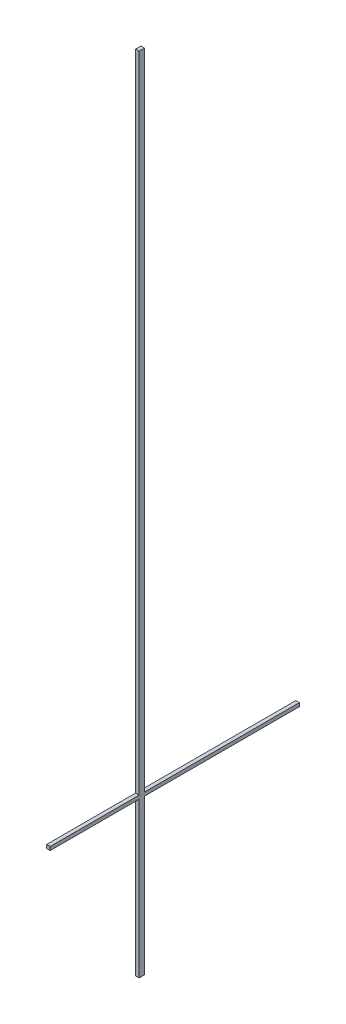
from build123d import *

# Parameters (mm, degrees)
SKETCH1_W           = 20
SKETCH1_H           = 30
BOSS_EXTRUDE1_DEPTH = 2710
SKETCH2_W           = 20
SKETCH2_H           = 30
BOSS_EXTRUDE2_DEPTH = 1800
SKETCH4_W           = 20
SKETCH4_H           = 20
BOSS_EXTRUDE3_DEPTH = 870
SKETCH5_W           = 20
SKETCH5_H           = 20
BOSS_EXTRUDE4_DEPTH = 500


with BuildPart() as part:
    # Sketch1 → Boss-Extrude1 (new body)
    with BuildSketch(Plane(origin=(0, 0, 0), x_dir=(1, 0, 0), z_dir=(0, 1, 0))):
        with Locations((10, 15)):
            Rectangle(SKETCH1_W, SKETCH1_H)
    extrude(amount=BOSS_EXTRUDE1_DEPTH)

    # Sketch2 → Boss-Extrude2 (add)
    with BuildSketch(Plane.XZ):
        with Locations((10, -15)):
            Rectangle(SKETCH2_W, SKETCH2_H)
    extrude(amount=BOSS_EXTRUDE2_DEPTH)

    # Sketch4 → Boss-Extrude3 (add)
    with BuildSketch(Plane(origin=(0, 0, -30), x_dir=(-1, 0, 0), z_dir=(0, 0, -1))):
        with Locations((-10, -920)):
            Rectangle(SKETCH4_W, SKETCH4_H)
    extrude(amount=BOSS_EXTRUDE3_DEPTH)

    # Sketch5 → Boss-Extrude4 (add)
    with BuildSketch(Plane.XY):
        with Locations((10, -920)):
            Rectangle(SKETCH5_W, SKETCH5_H)
    extrude(amount=BOSS_EXTRUDE4_DEPTH)


solid = part.part
